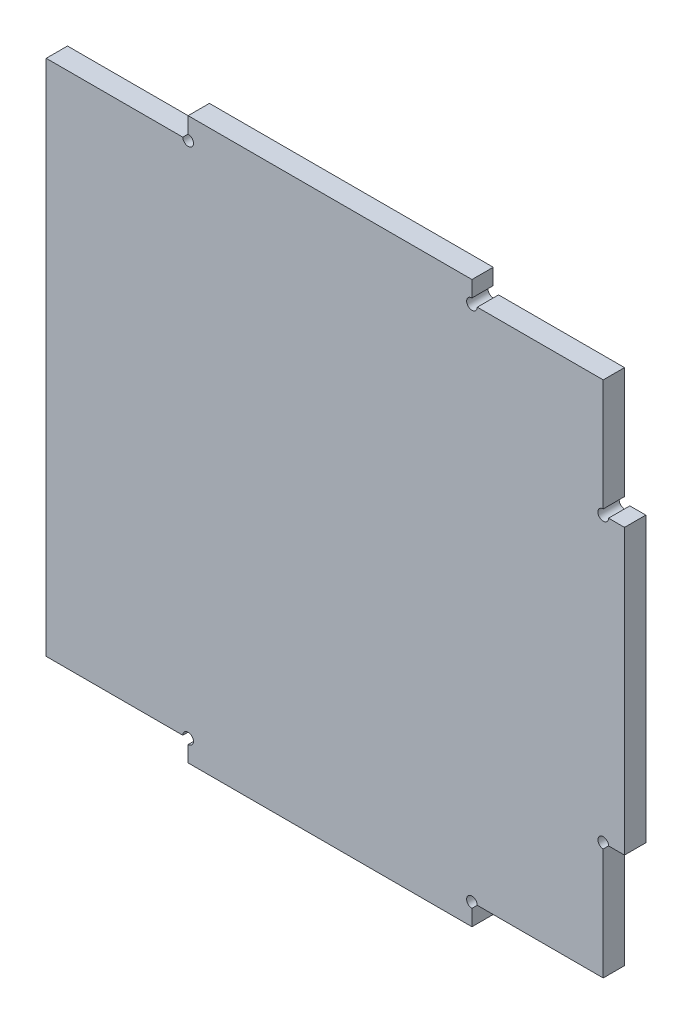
from build123d import *

# Parameters (mm, degrees)
BOSS_EXTRU_1_DEPTH      = 6
ESQUISSE4_R             = 1.5
ENL_V_MAT_EXTRU_3_DEPTH = 178.5988707


with BuildPart() as part:
    # Esquisse1 → Boss.-Extru.1 (new body)
    with BuildSketch(Plane.XY):
        Polygon((-97.629050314, 142.236052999), (-57.629050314, 142.236052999), (-57.629050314, 148.236052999), (22.370949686, 148.236052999), (22.370949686, 142.236052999), (59.370949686, 142.236052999), (59.370949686, 109.236052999), (65.370949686, 109.236052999), (65.370949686, 29.236052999), (59.370949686, 29.236052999), (59.370949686, -3.763947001), (22.370949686, -3.763947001), (22.370949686, -9.763947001), (-57.629050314, -9.763947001), (-57.629050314, -3.763947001), (-97.629050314, -3.763947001), align=None)
    extrude(amount=BOSS_EXTRU_1_DEPTH)

    # Esquisse4 → Enl_v. mat.-Extru.3 (cut, through all)
    with BuildSketch(Plane.XY.offset(6)):
        with Locations((-57.629050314, 142.236052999)):
            Circle(ESQUISSE4_R)
        with Locations((22.370949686, 142.236052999)):
            Circle(ESQUISSE4_R)
        with Locations((59.370949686, 109.236052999)):
            Circle(ESQUISSE4_R)
        with Locations((59.370949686, 29.236052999)):
            Circle(ESQUISSE4_R)
        with Locations((22.370949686, -3.763947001)):
            Circle(ESQUISSE4_R)
        with Locations((-57.629050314, -3.763947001)):
            Circle(ESQUISSE4_R)
    extrude(amount=-ENL_V_MAT_EXTRU_3_DEPTH, mode=Mode.SUBTRACT)


solid = part.part
